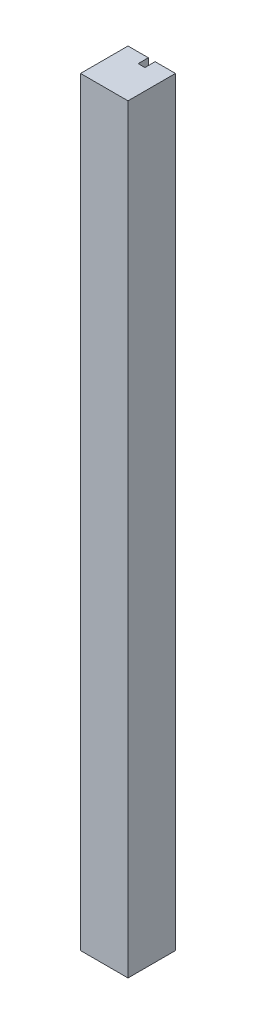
ISO-10303-21;
HEADER;
FILE_DESCRIPTION(('STEP AP214'),'2;1');
FILE_NAME('part.step','',(''),(''),'','','');
FILE_SCHEMA(('AUTOMOTIVE_DESIGN { 1 0 10303 214 1 1 1 1 }'));
ENDSEC;
DATA;
#1=APPLICATION_CONTEXT('core data for automotive mechanical design processes');
#2=APPLICATION_PROTOCOL_DEFINITION('international standard','automotive_design',2000,#1);
#3=PRODUCT_CONTEXT('',#1,'mechanical');
#4=PRODUCT('Part','Part','',(#3));
#5=PRODUCT_RELATED_PRODUCT_CATEGORY('part','',(#4));
#6=PRODUCT_DEFINITION_FORMATION('','',#4);
#7=PRODUCT_DEFINITION_CONTEXT('part definition',#1,'design');
#8=PRODUCT_DEFINITION('design','',#6,#7);
#9=PRODUCT_DEFINITION_SHAPE('','',#8);
#10=(LENGTH_UNIT() NAMED_UNIT(*) SI_UNIT(.MILLI.,.METRE.));
#11=(NAMED_UNIT(*) PLANE_ANGLE_UNIT() SI_UNIT($,.RADIAN.));
#12=(NAMED_UNIT(*) SI_UNIT($,.STERADIAN.) SOLID_ANGLE_UNIT());
#13=UNCERTAINTY_MEASURE_WITH_UNIT(LENGTH_MEASURE(1.E-05),#10,'distance_accuracy_value','');
#14=(GEOMETRIC_REPRESENTATION_CONTEXT(3) GLOBAL_UNCERTAINTY_ASSIGNED_CONTEXT((#13)) GLOBAL_UNIT_ASSIGNED_CONTEXT((#10,
#11,#12)) REPRESENTATION_CONTEXT('',''));
#15=CARTESIAN_POINT('',(0.,0.,0.));
#16=DIRECTION('',(0.,0.,1.));
#17=DIRECTION('',(1.,0.,0.));
#18=AXIS2_PLACEMENT_3D('',#15,#16,#17);
#19=CARTESIAN_POINT('',(0.,1422.4,-44.45));
#20=DIRECTION('',(0.,0.,-1.));
#21=DIRECTION('',(-1.,0.,0.));
#22=AXIS2_PLACEMENT_3D('',#19,#20,#21);
#23=PLANE('',#22);
#24=DIRECTION('',(1.,0.,0.));
#25=VECTOR('',#24,1.);
#26=CARTESIAN_POINT('',(0.,0.,-44.45));
#27=LINE('',#26,#25);
#28=CARTESIAN_POINT('',(6.35000000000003,0.,-44.45));
#29=VERTEX_POINT('',#28);
#30=CARTESIAN_POINT('',(44.45,0.,-44.45));
#31=VERTEX_POINT('',#30);
#32=EDGE_CURVE('E131',#29,#31,#27,.T.);
#33=ORIENTED_EDGE('',*,*,#32,.F.);
#34=DIRECTION('',(0.,-1.,0.));
#35=VECTOR('',#34,1.);
#36=CARTESIAN_POINT('',(6.35000000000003,1422.4,-44.45));
#37=LINE('',#36,#35);
#38=CARTESIAN_POINT('',(6.35000000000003,1422.4,-44.45));
#39=VERTEX_POINT('',#38);
#40=EDGE_CURVE('E11',#39,#29,#37,.T.);
#41=ORIENTED_EDGE('',*,*,#40,.F.);
#42=DIRECTION('',(1.,0.,0.));
#43=VECTOR('',#42,1.);
#44=CARTESIAN_POINT('',(0.,1422.4,-44.45));
#45=LINE('',#44,#43);
#46=CARTESIAN_POINT('',(44.45,1422.4,-44.45));
#47=VERTEX_POINT('',#46);
#48=EDGE_CURVE('E149',#39,#47,#45,.T.);
#49=ORIENTED_EDGE('',*,*,#48,.T.);
#50=DIRECTION('',(0.,-1.,0.));
#51=VECTOR('',#50,1.);
#52=CARTESIAN_POINT('',(44.45,1422.4,-44.45));
#53=LINE('',#52,#51);
#54=EDGE_CURVE('E53',#47,#31,#53,.T.);
#55=ORIENTED_EDGE('',*,*,#54,.T.);
#56=EDGE_LOOP('',(#33,#41,#49,#55));
#57=FACE_BOUND('',#56,.T.);
#58=ADVANCED_FACE('F36',(#57),#23,.T.);
#59=CARTESIAN_POINT('',(6.35000000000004,1422.4,0.));
#60=DIRECTION('',(1.,0.,0.));
#61=DIRECTION('',(0.,0.,-1.));
#62=AXIS2_PLACEMENT_3D('',#59,#60,#61);
#63=PLANE('',#62);
#64=DIRECTION('',(0.,0.,1.));
#65=VECTOR('',#64,1.);
#66=CARTESIAN_POINT('',(6.35000000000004,0.,0.));
#67=LINE('',#66,#65);
#68=CARTESIAN_POINT('',(6.35000000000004,0.,-25.4));
#69=VERTEX_POINT('',#68);
#70=EDGE_CURVE('E133',#29,#69,#67,.T.);
#71=ORIENTED_EDGE('',*,*,#70,.T.);
#72=DIRECTION('',(0.,-1.,0.));
#73=VECTOR('',#72,1.);
#74=CARTESIAN_POINT('',(6.35000000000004,1422.4,-25.4));
#75=LINE('',#74,#73);
#76=CARTESIAN_POINT('',(6.35000000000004,1422.4,-25.4));
#77=VERTEX_POINT('',#76);
#78=EDGE_CURVE('E45',#77,#69,#75,.T.);
#79=ORIENTED_EDGE('',*,*,#78,.F.);
#80=DIRECTION('',(0.,0.,1.));
#81=VECTOR('',#80,1.);
#82=CARTESIAN_POINT('',(6.35000000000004,1422.4,0.));
#83=LINE('',#82,#81);
#84=EDGE_CURVE('E174',#39,#77,#83,.T.);
#85=ORIENTED_EDGE('',*,*,#84,.F.);
#86=ORIENTED_EDGE('',*,*,#40,.T.);
#87=EDGE_LOOP('',(#71,#79,#85,#86));
#88=FACE_BOUND('',#87,.T.);
#89=ADVANCED_FACE('F38',(#88),#63,.F.);
#90=CARTESIAN_POINT('',(0.,1422.4,-25.4));
#91=DIRECTION('',(0.,0.,-1.));
#92=DIRECTION('',(-1.,0.,0.));
#93=AXIS2_PLACEMENT_3D('',#90,#91,#92);
#94=PLANE('',#93);
#95=DIRECTION('',(1.,0.,0.));
#96=VECTOR('',#95,1.);
#97=CARTESIAN_POINT('',(0.,0.,-25.4));
#98=LINE('',#97,#96);
#99=CARTESIAN_POINT('',(-6.34999999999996,0.,-25.4));
#100=VERTEX_POINT('',#99);
#101=EDGE_CURVE('E137',#100,#69,#98,.T.);
#102=ORIENTED_EDGE('',*,*,#101,.F.);
#103=DIRECTION('',(0.,-1.,0.));
#104=VECTOR('',#103,1.);
#105=CARTESIAN_POINT('',(-6.34999999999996,1422.4,-25.4));
#106=LINE('',#105,#104);
#107=CARTESIAN_POINT('',(-6.34999999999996,1422.4,-25.4));
#108=VERTEX_POINT('',#107);
#109=EDGE_CURVE('E155',#108,#100,#106,.T.);
#110=ORIENTED_EDGE('',*,*,#109,.F.);
#111=DIRECTION('',(1.,0.,0.));
#112=VECTOR('',#111,1.);
#113=CARTESIAN_POINT('',(0.,1422.4,-25.4));
#114=LINE('',#113,#112);
#115=EDGE_CURVE('E162',#108,#77,#114,.T.);
#116=ORIENTED_EDGE('',*,*,#115,.T.);
#117=ORIENTED_EDGE('',*,*,#78,.T.);
#118=EDGE_LOOP('',(#102,#110,#116,#117));
#119=FACE_BOUND('',#118,.T.);
#120=ADVANCED_FACE('F160',(#119),#94,.T.);
#121=CARTESIAN_POINT('',(-6.34999999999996,1422.4,0.));
#122=DIRECTION('',(1.,0.,0.));
#123=DIRECTION('',(0.,0.,-1.));
#124=AXIS2_PLACEMENT_3D('',#121,#122,#123);
#125=PLANE('',#124);
#126=DIRECTION('',(0.,0.,1.));
#127=VECTOR('',#126,1.);
#128=CARTESIAN_POINT('',(-6.34999999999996,0.,0.));
#129=LINE('',#128,#127);
#130=CARTESIAN_POINT('',(-6.34999999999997,0.,-44.45));
#131=VERTEX_POINT('',#130);
#132=EDGE_CURVE('E140',#131,#100,#129,.T.);
#133=ORIENTED_EDGE('',*,*,#132,.F.);
#134=DIRECTION('',(0.,-1.,0.));
#135=VECTOR('',#134,1.);
#136=CARTESIAN_POINT('',(-6.34999999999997,1422.4,-44.45));
#137=LINE('',#136,#135);
#138=CARTESIAN_POINT('',(-6.34999999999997,1422.4,-44.45));
#139=VERTEX_POINT('',#138);
#140=EDGE_CURVE('E153',#139,#131,#137,.T.);
#141=ORIENTED_EDGE('',*,*,#140,.F.);
#142=DIRECTION('',(0.,0.,1.));
#143=VECTOR('',#142,1.);
#144=CARTESIAN_POINT('',(-6.34999999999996,1422.4,0.));
#145=LINE('',#144,#143);
#146=EDGE_CURVE('E173',#139,#108,#145,.T.);
#147=ORIENTED_EDGE('',*,*,#146,.T.);
#148=ORIENTED_EDGE('',*,*,#109,.T.);
#149=EDGE_LOOP('',(#133,#141,#147,#148));
#150=FACE_BOUND('',#149,.T.);
#151=ADVANCED_FACE('F171',(#150),#125,.T.);
#152=CARTESIAN_POINT('',(-44.45,0.,-44.45));
#153=VERTEX_POINT('',#152);
#154=EDGE_CURVE('E134',#153,#131,#27,.T.);
#155=ORIENTED_EDGE('',*,*,#154,.F.);
#156=DIRECTION('',(0.,-1.,0.));
#157=VECTOR('',#156,1.);
#158=CARTESIAN_POINT('',(-44.45,1422.4,-44.45));
#159=LINE('',#158,#157);
#160=CARTESIAN_POINT('',(-44.45,1422.4,-44.45));
#161=VERTEX_POINT('',#160);
#162=EDGE_CURVE('E123',#161,#153,#159,.T.);
#163=ORIENTED_EDGE('',*,*,#162,.F.);
#164=EDGE_CURVE('E113',#161,#139,#45,.T.);
#165=ORIENTED_EDGE('',*,*,#164,.T.);
#166=ORIENTED_EDGE('',*,*,#140,.T.);
#167=EDGE_LOOP('',(#155,#163,#165,#166));
#168=FACE_BOUND('',#167,.T.);
#169=ADVANCED_FACE('F179',(#168),#23,.T.);
#170=CARTESIAN_POINT('',(-44.45,1422.4,0.));
#171=DIRECTION('',(1.,0.,0.));
#172=DIRECTION('',(0.,0.,-1.));
#173=AXIS2_PLACEMENT_3D('',#170,#171,#172);
#174=PLANE('',#173);
#175=DIRECTION('',(0.,0.,1.));
#176=VECTOR('',#175,1.);
#177=CARTESIAN_POINT('',(-44.45,0.,0.));
#178=LINE('',#177,#176);
#179=CARTESIAN_POINT('',(-44.45,0.,44.45));
#180=VERTEX_POINT('',#179);
#181=EDGE_CURVE('E120',#153,#180,#178,.T.);
#182=ORIENTED_EDGE('',*,*,#181,.T.);
#183=DIRECTION('',(0.,-1.,0.));
#184=VECTOR('',#183,1.);
#185=CARTESIAN_POINT('',(-44.45,1422.4,44.45));
#186=LINE('',#185,#184);
#187=CARTESIAN_POINT('',(-44.45,1422.4,44.45));
#188=VERTEX_POINT('',#187);
#189=EDGE_CURVE('E117',#188,#180,#186,.T.);
#190=ORIENTED_EDGE('',*,*,#189,.F.);
#191=DIRECTION('',(0.,0.,1.));
#192=VECTOR('',#191,1.);
#193=CARTESIAN_POINT('',(-44.45,1422.4,0.));
#194=LINE('',#193,#192);
#195=EDGE_CURVE('E104',#161,#188,#194,.T.);
#196=ORIENTED_EDGE('',*,*,#195,.F.);
#197=ORIENTED_EDGE('',*,*,#162,.T.);
#198=EDGE_LOOP('',(#182,#190,#196,#197));
#199=FACE_BOUND('',#198,.T.);
#200=ADVANCED_FACE('F118',(#199),#174,.F.);
#201=CARTESIAN_POINT('',(0.,1422.4,44.45));
#202=DIRECTION('',(0.,0.,-1.));
#203=DIRECTION('',(-1.,0.,0.));
#204=AXIS2_PLACEMENT_3D('',#201,#202,#203);
#205=PLANE('',#204);
#206=DIRECTION('',(1.,0.,0.));
#207=VECTOR('',#206,1.);
#208=CARTESIAN_POINT('',(0.,0.,44.45));
#209=LINE('',#208,#207);
#210=CARTESIAN_POINT('',(44.45,0.,44.45));
#211=VERTEX_POINT('',#210);
#212=EDGE_CURVE('E144',#180,#211,#209,.T.);
#213=ORIENTED_EDGE('',*,*,#212,.T.);
#214=DIRECTION('',(0.,-1.,0.));
#215=VECTOR('',#214,1.);
#216=CARTESIAN_POINT('',(44.45,1422.4,44.45));
#217=LINE('',#216,#215);
#218=CARTESIAN_POINT('',(44.45,1422.4,44.45));
#219=VERTEX_POINT('',#218);
#220=EDGE_CURVE('E79',#219,#211,#217,.T.);
#221=ORIENTED_EDGE('',*,*,#220,.F.);
#222=DIRECTION('',(1.,0.,0.));
#223=VECTOR('',#222,1.);
#224=CARTESIAN_POINT('',(0.,1422.4,44.45));
#225=LINE('',#224,#223);
#226=EDGE_CURVE('E110',#188,#219,#225,.T.);
#227=ORIENTED_EDGE('',*,*,#226,.F.);
#228=ORIENTED_EDGE('',*,*,#189,.T.);
#229=EDGE_LOOP('',(#213,#221,#227,#228));
#230=FACE_BOUND('',#229,.T.);
#231=ADVANCED_FACE('F125',(#230),#205,.F.);
#232=CARTESIAN_POINT('',(44.45,1422.4,0.));
#233=DIRECTION('',(1.,0.,0.));
#234=DIRECTION('',(0.,0.,-1.));
#235=AXIS2_PLACEMENT_3D('',#232,#233,#234);
#236=PLANE('',#235);
#237=DIRECTION('',(0.,0.,1.));
#238=VECTOR('',#237,1.);
#239=CARTESIAN_POINT('',(44.45,0.,0.));
#240=LINE('',#239,#238);
#241=EDGE_CURVE('E146',#31,#211,#240,.T.);
#242=ORIENTED_EDGE('',*,*,#241,.F.);
#243=ORIENTED_EDGE('',*,*,#54,.F.);
#244=DIRECTION('',(0.,0.,1.));
#245=VECTOR('',#244,1.);
#246=CARTESIAN_POINT('',(44.45,1422.4,0.));
#247=LINE('',#246,#245);
#248=EDGE_CURVE('E126',#47,#219,#247,.T.);
#249=ORIENTED_EDGE('',*,*,#248,.T.);
#250=ORIENTED_EDGE('',*,*,#220,.T.);
#251=EDGE_LOOP('',(#242,#243,#249,#250));
#252=FACE_BOUND('',#251,.T.);
#253=ADVANCED_FACE('F180',(#252),#236,.T.);
#254=CARTESIAN_POINT('',(0.,1422.4,0.));
#255=DIRECTION('',(0.,1.,0.));
#256=DIRECTION('',(0.,0.,1.));
#257=AXIS2_PLACEMENT_3D('',#254,#255,#256);
#258=PLANE('',#257);
#259=ORIENTED_EDGE('',*,*,#48,.F.);
#260=ORIENTED_EDGE('',*,*,#84,.T.);
#261=ORIENTED_EDGE('',*,*,#115,.F.);
#262=ORIENTED_EDGE('',*,*,#146,.F.);
#263=ORIENTED_EDGE('',*,*,#164,.F.);
#264=ORIENTED_EDGE('',*,*,#195,.T.);
#265=ORIENTED_EDGE('',*,*,#226,.T.);
#266=ORIENTED_EDGE('',*,*,#248,.F.);
#267=EDGE_LOOP('',(#259,#260,#261,#262,#263,#264,#265,#266));
#268=FACE_BOUND('',#267,.T.);
#269=ADVANCED_FACE('F107',(#268),#258,.T.);
#270=CARTESIAN_POINT('',(0.,0.,0.));
#271=DIRECTION('',(0.,1.,0.));
#272=DIRECTION('',(0.,0.,1.));
#273=AXIS2_PLACEMENT_3D('',#270,#271,#272);
#274=PLANE('',#273);
#275=ORIENTED_EDGE('',*,*,#32,.T.);
#276=ORIENTED_EDGE('',*,*,#241,.T.);
#277=ORIENTED_EDGE('',*,*,#212,.F.);
#278=ORIENTED_EDGE('',*,*,#181,.F.);
#279=ORIENTED_EDGE('',*,*,#154,.T.);
#280=ORIENTED_EDGE('',*,*,#132,.T.);
#281=ORIENTED_EDGE('',*,*,#101,.T.);
#282=ORIENTED_EDGE('',*,*,#70,.F.);
#283=EDGE_LOOP('',(#275,#276,#277,#278,#279,#280,#281,#282));
#284=FACE_BOUND('',#283,.T.);
#285=ADVANCED_FACE('F166',(#284),#274,.F.);
#286=CLOSED_SHELL('',(#58,#89,#120,#151,#169,#200,#231,#253,#269,#285));
#287=MANIFOLD_SOLID_BREP('B2',#286);
#288=ADVANCED_BREP_SHAPE_REPRESENTATION('',(#18,#287),#14);
#289=SHAPE_DEFINITION_REPRESENTATION(#9,#288);
ENDSEC;
END-ISO-10303-21;
